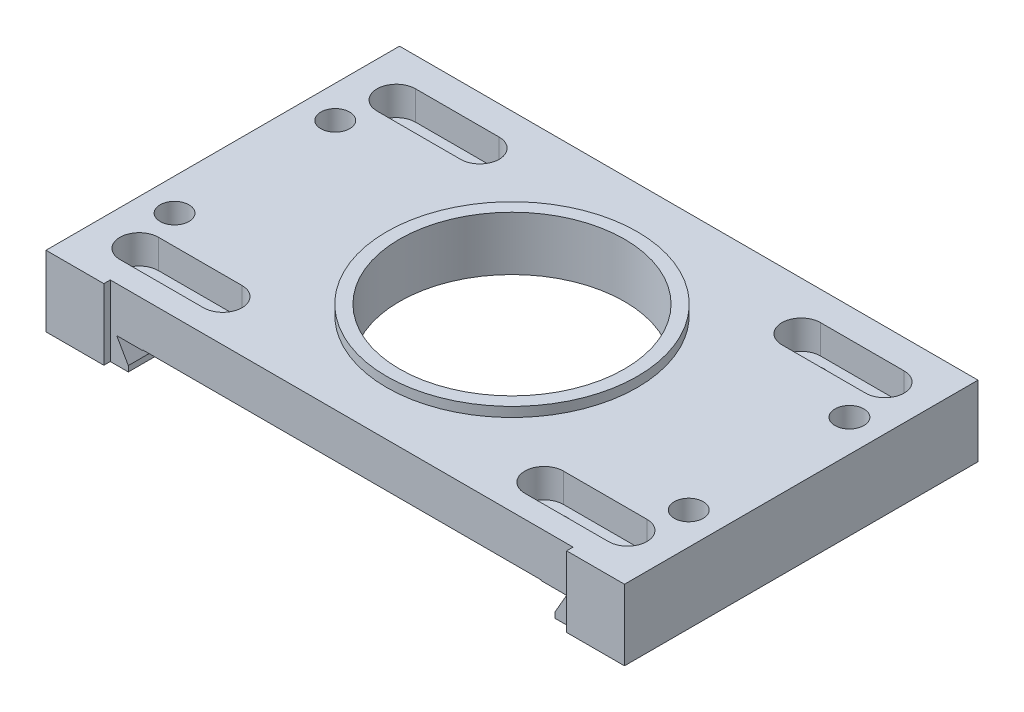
from build123d import *

# Parameters (mm, degrees)
SKETCH1_W                      = 55
SKETCH1_H                      = 11
BOSS_EXTRUDE1_DEPTH            = 45
CUT_EXTRUDE1_DEPTH             = 72.275872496
SKETCH15_W                     = 62
SKETCH15_H                     = 55
CUT_EXTRUDE3_DEPTH             = 0.1
SKETCH17_R                     = 19.5
BOSS_EXTRUDE2_DEPTH            = 1.5
SKETCH18_R                     = 17.5
CUT_EXTRUDE5_DEPTH             = 55.198708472
CUT_EXTRUDE6_DEPTH             = 4.5
MIRROR2_COPY_1_DEPTH           = 4.5
CBORE_FOR_M4_SHCS3_D           = 4.5
CBORE_FOR_M4_SHCS3_CBORE_D     = 8
CBORE_FOR_M4_SHCS3_CBORE_DEPTH = 4
SKETCH28_W                     = 72
SKETCH28_H                     = 11
CUT_EXTRUDE7_DEPTH             = 1
SKETCH29_W                     = 3.309401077
SKETCH29_H                     = 16
CUT_EXTRUDE8_DEPTH             = 4
CUT_EXTRUDE9_DEPTH             = 71.63993205
FILLET1_R                      = 2


with BuildPart() as part:
    # Sketch1 → Boss-Extrude1 (new, symmetric)
    with BuildSketch(Plane(origin=(0, 0, 0), x_dir=(0, 0, -1), z_dir=(1, 0, 0))):
        Rectangle(SKETCH1_W, SKETCH1_H)
    extrude(amount=BOSS_EXTRUDE1_DEPTH, both=True)

    # Sketch2 → Cut-Extrude1 (cut, through all)
    with BuildSketch(Plane.XY.offset(27.5)):
        Polygon((-32.690598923, -5.5), (-35, -1.5), (35, -1.5), (32.690598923, -5.5), align=None)
    extrude(amount=-CUT_EXTRUDE1_DEPTH, mode=Mode.SUBTRACT)

    # Sketch15 → Cut-Extrude3 (cut)
    with BuildSketch(Plane.XZ.offset(1.5)):
        Rectangle(SKETCH15_W, SKETCH15_H)
    extrude(amount=-CUT_EXTRUDE3_DEPTH, mode=Mode.SUBTRACT)

    # Sketch17 → Boss-Extrude2 (add)
    with BuildSketch(Plane(origin=(0, 5.5, 0), x_dir=(1, 0, 0), z_dir=(0, 1, 0))):
        with Locations(Location((0, 0, 0), (0, 0, 90))):
            Circle(SKETCH17_R)
    extrude(amount=BOSS_EXTRUDE2_DEPTH)

    # Sketch18 → Cut-Extrude5 (cut, through all)
    with BuildSketch(Plane(origin=(0, 7, 0), x_dir=(1, 0, 0), z_dir=(0, 1, 0))):
        with Locations(Location((0, 0, 0), (0, 0, 270))):
            Circle(SKETCH18_R)
    extrude(amount=-CUT_EXTRUDE5_DEPTH, mode=Mode.SUBTRACT)

    # Sketch22 → Cut-Extrude6 (cut)
    with BuildSketch(Plane(origin=(0, 5.5, 0), x_dir=(1, 0, 0), z_dir=(0, 1, 0))):
        with BuildLine():
            Line((-25, 17), (-38, 17))
            ThreePointArc((-38, 17), (-41, 20), (-38, 23))
            Line((-38, 23), (-25, 23))
            ThreePointArc((-25, 23), (-22, 20), (-25, 17))
        make_face()
    cut_extrude6 = extrude(amount=-CUT_EXTRUDE6_DEPTH, mode=Mode.SUBTRACT)

    # Sketch24 → M3x0.5 Tapped Hole1 (revolve, cut)
    with BuildSketch(Plane(origin=(-37.5, 1, -20), x_dir=(0, 0, 1), z_dir=(1, 0, 0))):
        Polygon((0, 0), (0, 5.251075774), (1.25, 4.5), (1.25, 0), align=None)
    m3x0_5_tapped_hole1 = revolve(axis=Axis((-37.5, 7.35, -20), (0, -1, 0)), mode=Mode.SUBTRACT)

    # Sketch31 → 3.1 _3.1_ Diameter Hole1 (revolve, cut)
    with BuildSketch(Plane(origin=(-27, 1, -20), x_dir=(0, 0, 1), z_dir=(1, 0, 0))):
        Polygon((0, 0), (0, 3.131333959), (1.55, 2.2), (1.55, 0), align=None)
    f_3_1_3_1_diameter_hole1 = revolve(axis=Axis((-27, 7.35, -20), (0, -1, 0)), mode=Mode.SUBTRACT)

    # Mirror1: Cut-Extrude6, M3x0.5 Tapped Hole1, 3.1 _3.1_ Diameter Hole1 across plane
    add(cut_extrude6.mirror(Plane.XY), mode=Mode.SUBTRACT)
    add(m3x0_5_tapped_hole1.mirror(Plane.XY), mode=Mode.SUBTRACT)
    add(f_3_1_3_1_diameter_hole1.mirror(Plane.XY), mode=Mode.SUBTRACT)

    # Mirror2: Cut-Extrude6, M3x0.5 Tapped Hole1, 3.1 _3.1_ Diameter Hole1 across plane
    add(cut_extrude6.mirror(Plane(origin=(0, 0, 0), x_dir=(0, 0, 1), z_dir=(1, 0, 0))), mode=Mode.SUBTRACT)
    add(m3x0_5_tapped_hole1.mirror(Plane(origin=(0, 0, 0), x_dir=(0, 0, 1), z_dir=(1, 0, 0))), mode=Mode.SUBTRACT)
    add(f_3_1_3_1_diameter_hole1.mirror(Plane(origin=(0, 0, 0), x_dir=(0, 0, 1), z_dir=(1, 0, 0))), mode=Mode.SUBTRACT)

    # Mirror2 copy 1 sketch → Mirror2 copy 1 (cut)
    with BuildSketch(Plane(origin=(0, 5.5, 0), x_dir=(-1, 0, 0), z_dir=(0, 1, 0))):
        with BuildLine():
            Line((-25, 17), (-38, 17))
            ThreePointArc((-38, 17), (-41, 20), (-38, 23))
            Line((-38, 23), (-25, 23))
            ThreePointArc((-25, 23), (-22, 20), (-25, 17))
        make_face()
    extrude(amount=-MIRROR2_COPY_1_DEPTH, mode=Mode.SUBTRACT)

    # Mirror2 copy 2 sketch → Mirror2 copy 2 (revolve, cut)
    with BuildSketch(Plane(origin=(37.5, 1, 20), x_dir=(0, 0, -1), z_dir=(-1, 0, 0))):
        Polygon((0, 0), (0, 5.251075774), (1.25, 4.5), (1.25, 0), align=None)
    revolve(axis=Axis((37.5, 7.35, 20), (0, -1, 0)), mode=Mode.SUBTRACT)

    # Mirror2 copy 3 sketch → Mirror2 copy 3 (revolve, cut)
    with BuildSketch(Plane(origin=(27, 1, 20), x_dir=(0, 0, -1), z_dir=(-1, 0, 0))):
        Polygon((0, 0), (0, 3.131333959), (1.55, 2.2), (1.55, 0), align=None)
    revolve(axis=Axis((27, 7.35, 20), (0, -1, 0)), mode=Mode.SUBTRACT)

    # CBORE for M4 SHCS3 (through all)
    with Locations(Plane(origin=(0, -5.5, 0), x_dir=(-1, 0, 0), z_dir=(0, -1, 0))):
        with Locations((40, -12.5), (40, 12.5), (-40, -12.5), (-40, 12.5)):
            CounterBoreHole(CBORE_FOR_M4_SHCS3_D / 2, CBORE_FOR_M4_SHCS3_CBORE_D / 2, CBORE_FOR_M4_SHCS3_CBORE_DEPTH)

    # Sketch28 → Cut-Extrude7 (cut)
    with BuildSketch(Plane.XY.offset(27.5)):
        Rectangle(SKETCH28_W, SKETCH28_H)
    extrude(amount=-CUT_EXTRUDE7_DEPTH, mode=Mode.SUBTRACT)

    # Sketch29 → Cut-Extrude8 (cut)
    with BuildSketch(Plane.XZ.offset(5.5)):
        with Locations((-34.345299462, -0.5)):
            Rectangle(SKETCH29_W, SKETCH29_H)
        with Locations((34.345299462, -0.5)):
            Rectangle(SKETCH29_W, SKETCH29_H)
    extrude(amount=-CUT_EXTRUDE8_DEPTH, mode=Mode.SUBTRACT)

    # Sketch30 → Cut-Extrude9 (cut, through all)
    with BuildSketch(Plane.XY.offset(26.5)):
        Polygon((-32.690598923, -5.5), (-33.190598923, -4.633974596), (-33.190598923, -5.5), align=None)
    cut_extrude9 = extrude(amount=-CUT_EXTRUDE9_DEPTH, mode=Mode.SUBTRACT)

    # Mirror3: Cut-Extrude9 across plane
    add(cut_extrude9.mirror(Plane(origin=(0, 0, 0), x_dir=(0, 0, 1), z_dir=(1, 0, 0))), mode=Mode.SUBTRACT)

    # Fillet1
    fillet1_edges = [part.edges().sort_by_distance(p)[0] for p in [
        (36, -3.5, 7.5),
        (36, -3.5, -8.5),
        (-36, -3.5, -8.5),
        (-36, -3.5, 7.5),
    ]]
    fillet(fillet1_edges, radius=FILLET1_R)


solid = part.part
